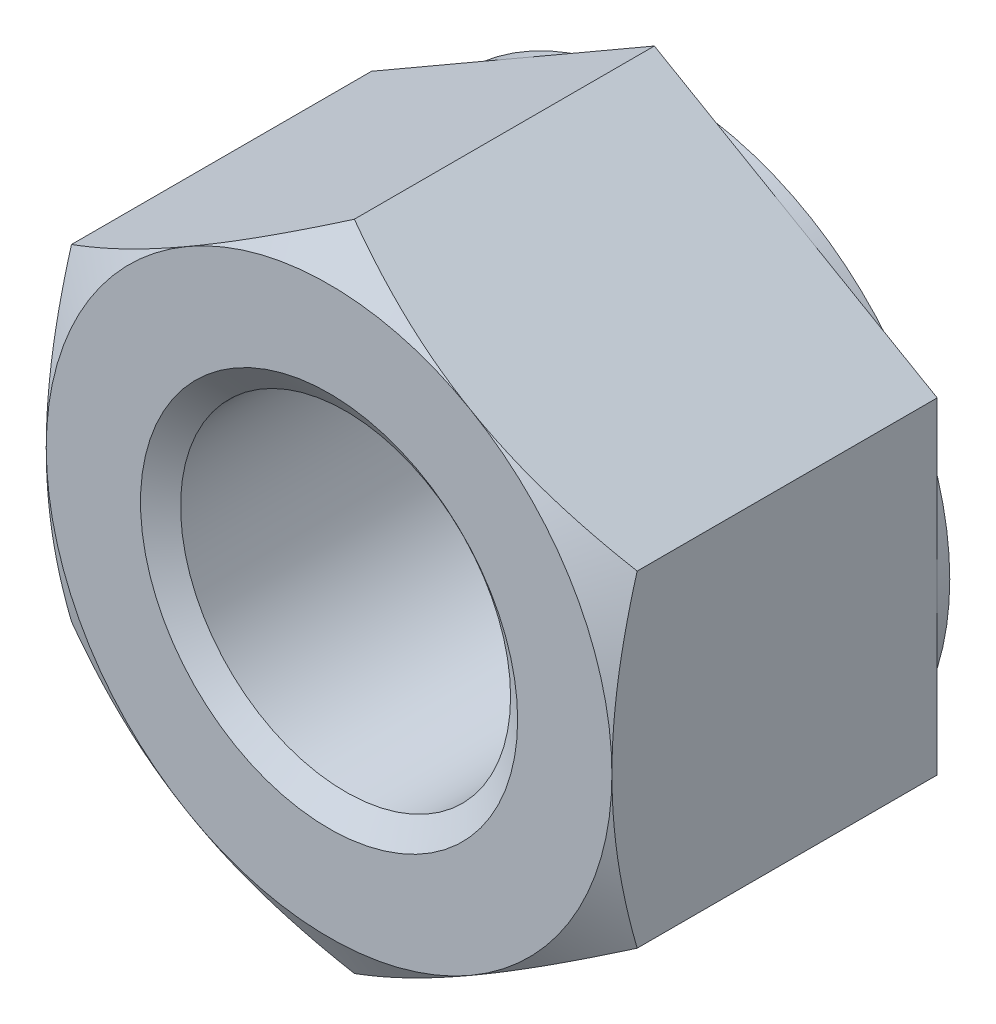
from build123d import *

# Parameters (mm, degrees)
BASENUTSKE_R  = 10.5
BASENUT_DEPTH = 21.5
SKETCH4_W     = 0.8
SKETCH4_H     = 12.784609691


with BuildPart() as part:
    # BaseNutSke → BaseNut (new body)
    with BuildSketch(Plane.XY):
        Polygon((18, 10.392304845), (18, -10.392304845), (0, -20.784609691), (-18, -10.392304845), (-18, 10.392304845), (0, 20.784609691), align=None)
        Circle(BASENUTSKE_R, mode=Mode.SUBTRACT)
    extrude(amount=-BASENUT_DEPTH)

    # Sketch4 → Bearing-Face (revolve, cut)
    with BuildSketch(Plane(origin=(0, 0, 0), x_dir=(0, 0, -1), z_dir=(1, 0, 0)), mode=Mode.PRIVATE) as bearing_face_sk:
        with Locations((21.1, 24.392304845)):
            Rectangle(SKETCH4_W, SKETCH4_H)
        Polygon((0, 18), (-10, 18), (-10, 30.784609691), (1.607695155, 30.784609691), (1.607695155, 20.784609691), align=None)
    revolve(bearing_face_sk.sketch.rotate(Axis((0, 0, 0), (0, 0, -1)), 90), axis=Axis((0, 0, 0), (0, 0, -1)), mode=Mode.SUBTRACT)

    # Sketch5 (on Right Plane) → EndChamfer (revolve, cut)
    with BuildSketch(Plane(origin=(0, 0, 0), x_dir=(0, 0, -1), z_dir=(1, 0, 0)), mode=Mode.PRIVATE) as endchamfer_sk:
        Polygon((21.5, 12), (20.449688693, 10.5), (21.5, 10.5), align=None)
        Polygon((0, 12), (1.050311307, 10.5), (0, 10.5), align=None)
    revolve(endchamfer_sk.sketch.rotate(Axis((0, 0, -22.606682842), (0, 0, -1)), 90), axis=Axis((0, 0, -22.606682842), (0, 0, -1)), mode=Mode.SUBTRACT)


solid = part.part
